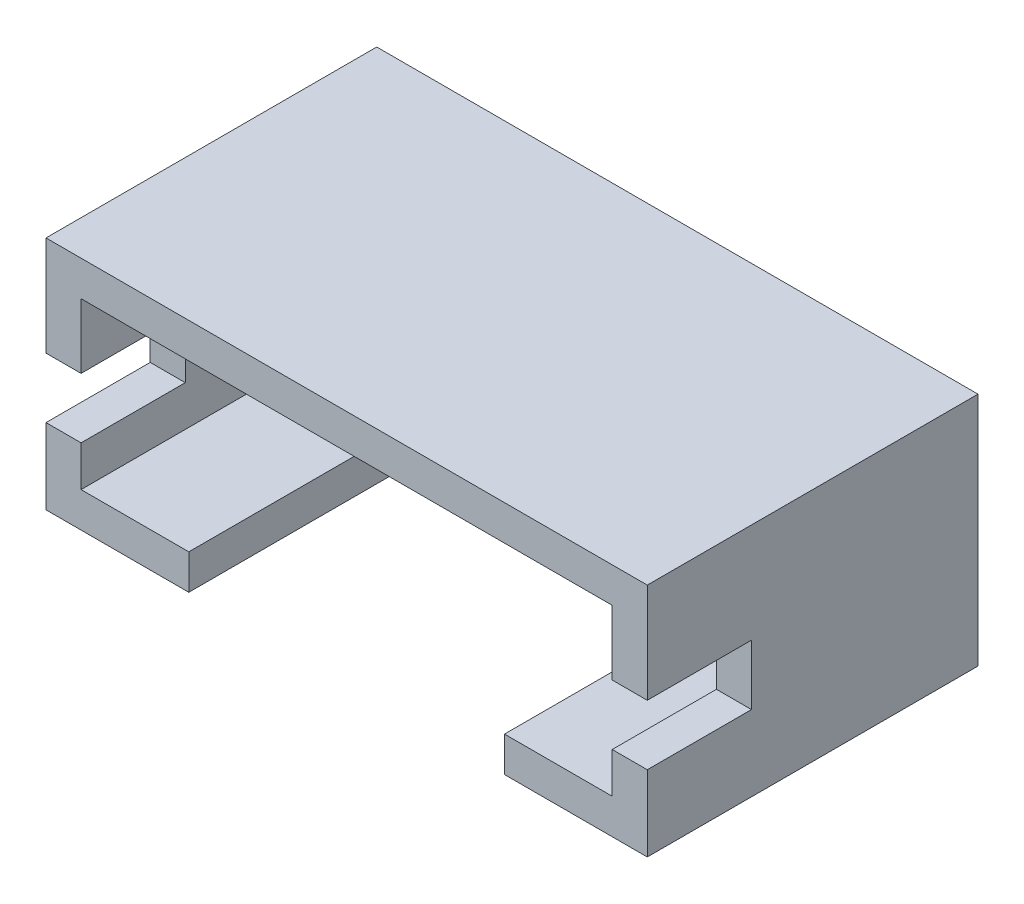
ISO-10303-21;
HEADER;
FILE_DESCRIPTION(('STEP AP214'),'2;1');
FILE_NAME('part.step','',(''),(''),'','','');
FILE_SCHEMA(('AUTOMOTIVE_DESIGN { 1 0 10303 214 1 1 1 1 }'));
ENDSEC;
DATA;
#1=APPLICATION_CONTEXT('core data for automotive mechanical design processes');
#2=APPLICATION_PROTOCOL_DEFINITION('international standard','automotive_design',2000,#1);
#3=PRODUCT_CONTEXT('',#1,'mechanical');
#4=PRODUCT('Part','Part','',(#3));
#5=PRODUCT_RELATED_PRODUCT_CATEGORY('part','',(#4));
#6=PRODUCT_DEFINITION_FORMATION('','',#4);
#7=PRODUCT_DEFINITION_CONTEXT('part definition',#1,'design');
#8=PRODUCT_DEFINITION('design','',#6,#7);
#9=PRODUCT_DEFINITION_SHAPE('','',#8);
#10=(LENGTH_UNIT() NAMED_UNIT(*) SI_UNIT(.MILLI.,.METRE.));
#11=(NAMED_UNIT(*) PLANE_ANGLE_UNIT() SI_UNIT($,.RADIAN.));
#12=(NAMED_UNIT(*) SI_UNIT($,.STERADIAN.) SOLID_ANGLE_UNIT());
#13=UNCERTAINTY_MEASURE_WITH_UNIT(LENGTH_MEASURE(1.E-05),#10,'distance_accuracy_value','');
#14=(GEOMETRIC_REPRESENTATION_CONTEXT(3) GLOBAL_UNCERTAINTY_ASSIGNED_CONTEXT((#13)) GLOBAL_UNIT_ASSIGNED_CONTEXT((#10,
#11,#12)) REPRESENTATION_CONTEXT('',''));
#15=CARTESIAN_POINT('',(0.,0.,0.));
#16=DIRECTION('',(0.,0.,1.));
#17=DIRECTION('',(1.,0.,0.));
#18=AXIS2_PLACEMENT_3D('',#15,#16,#17);
#19=CARTESIAN_POINT('',(22.2272344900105,4.7,0.));
#20=DIRECTION('',(0.,0.,-1.));
#21=DIRECTION('',(-1.,0.,0.));
#22=AXIS2_PLACEMENT_3D('',#19,#20,#21);
#23=PLANE('',#22);
#24=CARTESIAN_POINT('',(26.2426184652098,2.34999999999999,0.));
#25=DIRECTION('',(0.,0.,-1.));
#26=DIRECTION('',(-1.,0.,0.));
#27=AXIS2_PLACEMENT_3D('',#24,#25,#26);
#28=CIRCLE('',#27,0.302875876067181);
#29=CARTESIAN_POINT('',(25.9397425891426,2.34999999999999,0.));
#30=VERTEX_POINT('',#29);
#31=EDGE_CURVE('E691',#30,#30,#28,.F.);
#32=ORIENTED_EDGE('',*,*,#31,.T.);
#33=EDGE_LOOP('',(#32));
#34=FACE_BOUND('',#33,.T.);
#35=CARTESIAN_POINT('',(30.2426184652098,2.35,0.));
#36=DIRECTION('',(0.,0.,-1.));
#37=DIRECTION('',(-1.,0.,0.));
#38=AXIS2_PLACEMENT_3D('',#35,#36,#37);
#39=CIRCLE('',#38,0.302875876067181);
#40=CARTESIAN_POINT('',(29.9397425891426,2.35,0.));
#41=VERTEX_POINT('',#40);
#42=EDGE_CURVE('E708',#41,#41,#39,.F.);
#43=ORIENTED_EDGE('',*,*,#42,.T.);
#44=EDGE_LOOP('',(#43));
#45=FACE_BOUND('',#44,.T.);
#46=DIRECTION('',(0.,-1.,0.));
#47=VECTOR('',#46,1.);
#48=CARTESIAN_POINT('',(22.2272344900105,0.,0.));
#49=LINE('',#48,#47);
#50=CARTESIAN_POINT('',(22.2272344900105,4.7,0.));
#51=VERTEX_POINT('',#50);
#52=CARTESIAN_POINT('',(22.2272344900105,0.,0.));
#53=VERTEX_POINT('',#52);
#54=EDGE_CURVE('E345',#51,#53,#49,.T.);
#55=ORIENTED_EDGE('',*,*,#54,.F.);
#56=DIRECTION('',(-1.,0.,0.));
#57=VECTOR('',#56,1.);
#58=CARTESIAN_POINT('',(22.2272344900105,4.7,0.));
#59=LINE('',#58,#57);
#60=CARTESIAN_POINT('',(34.2272344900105,4.7,0.));
#61=VERTEX_POINT('',#60);
#62=EDGE_CURVE('E378',#61,#51,#59,.T.);
#63=ORIENTED_EDGE('',*,*,#62,.F.);
#64=DIRECTION('',(0.,1.,0.));
#65=VECTOR('',#64,1.);
#66=CARTESIAN_POINT('',(34.2272344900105,0.,0.));
#67=LINE('',#66,#65);
#68=CARTESIAN_POINT('',(34.2272344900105,0.,0.));
#69=VERTEX_POINT('',#68);
#70=EDGE_CURVE('E377',#69,#61,#67,.T.);
#71=ORIENTED_EDGE('',*,*,#70,.F.);
#72=DIRECTION('',(1.,0.,0.));
#73=VECTOR('',#72,1.);
#74=CARTESIAN_POINT('',(22.2272344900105,0.,0.));
#75=LINE('',#74,#73);
#76=EDGE_CURVE('E375',#53,#69,#75,.T.);
#77=ORIENTED_EDGE('',*,*,#76,.F.);
#78=EDGE_LOOP('',(#55,#63,#71,#77));
#79=FACE_BOUND('',#78,.T.);
#80=CARTESIAN_POINT('',(28.2272344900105,2.35,0.));
#81=DIRECTION('',(0.,0.,-1.));
#82=DIRECTION('',(-1.,0.,0.));
#83=AXIS2_PLACEMENT_3D('',#80,#81,#82);
#84=CIRCLE('',#83,0.302875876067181);
#85=CARTESIAN_POINT('',(27.9243586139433,2.35,0.));
#86=VERTEX_POINT('',#85);
#87=EDGE_CURVE('E413',#86,#86,#84,.F.);
#88=ORIENTED_EDGE('',*,*,#87,.T.);
#89=EDGE_LOOP('',(#88));
#90=FACE_BOUND('',#89,.T.);
#91=CARTESIAN_POINT('',(32.2580024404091,2.35,0.));
#92=DIRECTION('',(0.,0.,-1.));
#93=DIRECTION('',(-1.,0.,0.));
#94=AXIS2_PLACEMENT_3D('',#91,#92,#93);
#95=CIRCLE('',#94,0.302875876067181);
#96=CARTESIAN_POINT('',(31.9551265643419,2.35,0.));
#97=VERTEX_POINT('',#96);
#98=EDGE_CURVE('E699',#97,#97,#95,.F.);
#99=ORIENTED_EDGE('',*,*,#98,.T.);
#100=EDGE_LOOP('',(#99));
#101=FACE_BOUND('',#100,.T.);
#102=CARTESIAN_POINT('',(24.2580024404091,2.34999999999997,0.));
#103=DIRECTION('',(0.,0.,-1.));
#104=DIRECTION('',(-1.,0.,0.));
#105=AXIS2_PLACEMENT_3D('',#102,#103,#104);
#106=CIRCLE('',#105,0.302875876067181);
#107=CARTESIAN_POINT('',(23.9551265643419,2.34999999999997,0.));
#108=VERTEX_POINT('',#107);
#109=EDGE_CURVE('E680',#108,#108,#106,.F.);
#110=ORIENTED_EDGE('',*,*,#109,.T.);
#111=EDGE_LOOP('',(#110));
#112=FACE_BOUND('',#111,.T.);
#113=ADVANCED_FACE('F31',(#34,#45,#79,#90,#101,#112),#23,.T.);
#114=CARTESIAN_POINT('',(22.2272344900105,4.7,0.7));
#115=DIRECTION('',(0.,0.,-1.));
#116=DIRECTION('',(-1.,0.,0.));
#117=AXIS2_PLACEMENT_3D('',#114,#115,#116);
#118=PLANE('',#117);
#119=CARTESIAN_POINT('',(26.2426184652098,2.34999999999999,0.7));
#120=DIRECTION('',(0.,0.,-1.));
#121=DIRECTION('',(-1.,0.,0.));
#122=AXIS2_PLACEMENT_3D('',#119,#120,#121);
#123=CIRCLE('',#122,0.302875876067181);
#124=CARTESIAN_POINT('',(25.9397425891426,2.34999999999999,0.7));
#125=VERTEX_POINT('',#124);
#126=EDGE_CURVE('E39',#125,#125,#123,.F.);
#127=ORIENTED_EDGE('',*,*,#126,.F.);
#128=EDGE_LOOP('',(#127));
#129=FACE_BOUND('',#128,.T.);
#130=CARTESIAN_POINT('',(30.2426184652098,2.35,0.7));
#131=DIRECTION('',(0.,0.,-1.));
#132=DIRECTION('',(-1.,0.,0.));
#133=AXIS2_PLACEMENT_3D('',#130,#131,#132);
#134=CIRCLE('',#133,0.302875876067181);
#135=CARTESIAN_POINT('',(29.9397425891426,2.35,0.7));
#136=VERTEX_POINT('',#135);
#137=EDGE_CURVE('E228',#136,#136,#134,.F.);
#138=ORIENTED_EDGE('',*,*,#137,.F.);
#139=EDGE_LOOP('',(#138));
#140=FACE_BOUND('',#139,.T.);
#141=DIRECTION('',(0.,-1.,0.));
#142=VECTOR('',#141,1.);
#143=CARTESIAN_POINT('',(22.9272344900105,4.7,0.7));
#144=LINE('',#143,#142);
#145=CARTESIAN_POINT('',(22.9272344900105,4.,0.7));
#146=VERTEX_POINT('',#145);
#147=CARTESIAN_POINT('',(22.9272344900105,0.699999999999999,0.7));
#148=VERTEX_POINT('',#147);
#149=EDGE_CURVE('E247',#146,#148,#144,.T.);
#150=ORIENTED_EDGE('',*,*,#149,.T.);
#151=DIRECTION('',(1.,0.,0.));
#152=VECTOR('',#151,1.);
#153=CARTESIAN_POINT('',(22.2272344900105,0.699999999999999,0.7));
#154=LINE('',#153,#152);
#155=CARTESIAN_POINT('',(33.5272344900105,0.7,0.7));
#156=VERTEX_POINT('',#155);
#157=EDGE_CURVE('E341',#148,#156,#154,.T.);
#158=ORIENTED_EDGE('',*,*,#157,.T.);
#159=DIRECTION('',(0.,1.,0.));
#160=VECTOR('',#159,1.);
#161=CARTESIAN_POINT('',(33.5272344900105,4.7,0.7));
#162=LINE('',#161,#160);
#163=CARTESIAN_POINT('',(33.5272344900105,4.,0.7));
#164=VERTEX_POINT('',#163);
#165=EDGE_CURVE('E353',#156,#164,#162,.T.);
#166=ORIENTED_EDGE('',*,*,#165,.T.);
#167=DIRECTION('',(-1.,0.,0.));
#168=VECTOR('',#167,1.);
#169=CARTESIAN_POINT('',(22.2272344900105,4.,0.7));
#170=LINE('',#169,#168);
#171=EDGE_CURVE('E357',#164,#146,#170,.T.);
#172=ORIENTED_EDGE('',*,*,#171,.T.);
#173=EDGE_LOOP('',(#150,#158,#166,#172));
#174=FACE_BOUND('',#173,.T.);
#175=CARTESIAN_POINT('',(28.2272344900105,2.35,0.7));
#176=DIRECTION('',(0.,0.,-1.));
#177=DIRECTION('',(-1.,0.,0.));
#178=AXIS2_PLACEMENT_3D('',#175,#176,#177);
#179=CIRCLE('',#178,0.302875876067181);
#180=CARTESIAN_POINT('',(27.9243586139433,2.35,0.7));
#181=VERTEX_POINT('',#180);
#182=EDGE_CURVE('E225',#181,#181,#179,.F.);
#183=ORIENTED_EDGE('',*,*,#182,.F.);
#184=EDGE_LOOP('',(#183));
#185=FACE_BOUND('',#184,.T.);
#186=CARTESIAN_POINT('',(32.2580024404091,2.35,0.7));
#187=DIRECTION('',(0.,0.,-1.));
#188=DIRECTION('',(-1.,0.,0.));
#189=AXIS2_PLACEMENT_3D('',#186,#187,#188);
#190=CIRCLE('',#189,0.302875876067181);
#191=CARTESIAN_POINT('',(31.9551265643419,2.35,0.7));
#192=VERTEX_POINT('',#191);
#193=EDGE_CURVE('E231',#192,#192,#190,.F.);
#194=ORIENTED_EDGE('',*,*,#193,.F.);
#195=EDGE_LOOP('',(#194));
#196=FACE_BOUND('',#195,.T.);
#197=CARTESIAN_POINT('',(24.2580024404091,2.34999999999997,0.7));
#198=DIRECTION('',(0.,0.,-1.));
#199=DIRECTION('',(-1.,0.,0.));
#200=AXIS2_PLACEMENT_3D('',#197,#198,#199);
#201=CIRCLE('',#200,0.302875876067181);
#202=CARTESIAN_POINT('',(23.9551265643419,2.34999999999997,0.7));
#203=VERTEX_POINT('',#202);
#204=EDGE_CURVE('E11',#203,#203,#201,.F.);
#205=ORIENTED_EDGE('',*,*,#204,.F.);
#206=EDGE_LOOP('',(#205));
#207=FACE_BOUND('',#206,.T.);
#208=ADVANCED_FACE('F238',(#129,#140,#174,#185,#196,#207),#118,.F.);
#209=CARTESIAN_POINT('',(22.2272344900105,4.7,6.6));
#210=DIRECTION('',(0.,0.,-1.));
#211=DIRECTION('',(-1.,0.,0.));
#212=AXIS2_PLACEMENT_3D('',#209,#210,#211);
#213=PLANE('',#212);
#214=DIRECTION('',(1.,0.,0.));
#215=VECTOR('',#214,1.);
#216=CARTESIAN_POINT('',(22.2272344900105,0.,6.6));
#217=LINE('',#216,#215);
#218=CARTESIAN_POINT('',(22.2272344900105,0.,6.6));
#219=VERTEX_POINT('',#218);
#220=CARTESIAN_POINT('',(25.0772344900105,0.,6.6));
#221=VERTEX_POINT('',#220);
#222=EDGE_CURVE('E187',#219,#221,#217,.T.);
#223=ORIENTED_EDGE('',*,*,#222,.T.);
#224=DIRECTION('',(0.,-1.,0.));
#225=VECTOR('',#224,1.);
#226=CARTESIAN_POINT('',(25.0772344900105,4.701,6.6));
#227=LINE('',#226,#225);
#228=CARTESIAN_POINT('',(25.0772344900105,0.699999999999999,6.6));
#229=VERTEX_POINT('',#228);
#230=EDGE_CURVE('E168',#229,#221,#227,.T.);
#231=ORIENTED_EDGE('',*,*,#230,.F.);
#232=DIRECTION('',(1.,0.,0.));
#233=VECTOR('',#232,1.);
#234=CARTESIAN_POINT('',(22.2272344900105,0.699999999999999,6.6));
#235=LINE('',#234,#233);
#236=CARTESIAN_POINT('',(22.9272344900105,0.699999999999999,6.6));
#237=VERTEX_POINT('',#236);
#238=EDGE_CURVE('E366',#237,#229,#235,.T.);
#239=ORIENTED_EDGE('',*,*,#238,.F.);
#240=DIRECTION('',(0.,-1.,0.));
#241=VECTOR('',#240,1.);
#242=CARTESIAN_POINT('',(22.9272344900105,4.7,6.6));
#243=LINE('',#242,#241);
#244=CARTESIAN_POINT('',(22.9272344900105,1.50856992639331,6.6));
#245=VERTEX_POINT('',#244);
#246=EDGE_CURVE('E361',#245,#237,#243,.T.);
#247=ORIENTED_EDGE('',*,*,#246,.F.);
#248=DIRECTION('',(1.,0.,0.));
#249=VECTOR('',#248,1.);
#250=CARTESIAN_POINT('',(22.2272344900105,1.50856992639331,6.6));
#251=LINE('',#250,#249);
#252=CARTESIAN_POINT('',(22.2272344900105,1.50856992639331,6.6));
#253=VERTEX_POINT('',#252);
#254=EDGE_CURVE('E54',#253,#245,#251,.T.);
#255=ORIENTED_EDGE('',*,*,#254,.F.);
#256=DIRECTION('',(0.,-1.,0.));
#257=VECTOR('',#256,1.);
#258=CARTESIAN_POINT('',(22.2272344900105,0.,6.6));
#259=LINE('',#258,#257);
#260=EDGE_CURVE('E194',#253,#219,#259,.T.);
#261=ORIENTED_EDGE('',*,*,#260,.T.);
#262=EDGE_LOOP('',(#223,#231,#239,#247,#255,#261));
#263=FACE_BOUND('',#262,.T.);
#264=ADVANCED_FACE('F192',(#263),#213,.F.);
#265=CARTESIAN_POINT('',(22.2272344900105,4.7,6.6));
#266=VERTEX_POINT('',#265);
#267=CARTESIAN_POINT('',(22.2272344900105,2.70856992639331,6.6));
#268=VERTEX_POINT('',#267);
#269=EDGE_CURVE('E200',#266,#268,#259,.T.);
#270=ORIENTED_EDGE('',*,*,#269,.T.);
#271=DIRECTION('',(1.,0.,0.));
#272=VECTOR('',#271,1.);
#273=CARTESIAN_POINT('',(22.2272344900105,2.70856992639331,6.6));
#274=LINE('',#273,#272);
#275=CARTESIAN_POINT('',(22.9272344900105,2.70856992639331,6.6));
#276=VERTEX_POINT('',#275);
#277=EDGE_CURVE('E322',#268,#276,#274,.T.);
#278=ORIENTED_EDGE('',*,*,#277,.T.);
#279=CARTESIAN_POINT('',(22.9272344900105,4.,6.6));
#280=VERTEX_POINT('',#279);
#281=EDGE_CURVE('E362',#280,#276,#243,.T.);
#282=ORIENTED_EDGE('',*,*,#281,.F.);
#283=DIRECTION('',(-1.,0.,0.));
#284=VECTOR('',#283,1.);
#285=CARTESIAN_POINT('',(22.2272344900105,4.,6.6));
#286=LINE('',#285,#284);
#287=CARTESIAN_POINT('',(33.5272344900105,4.,6.6));
#288=VERTEX_POINT('',#287);
#289=EDGE_CURVE('E351',#288,#280,#286,.T.);
#290=ORIENTED_EDGE('',*,*,#289,.F.);
#291=DIRECTION('',(0.,1.,0.));
#292=VECTOR('',#291,1.);
#293=CARTESIAN_POINT('',(33.5272344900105,4.7,6.6));
#294=LINE('',#293,#292);
#295=CARTESIAN_POINT('',(33.5272344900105,2.70856992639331,6.6));
#296=VERTEX_POINT('',#295);
#297=EDGE_CURVE('E368',#296,#288,#294,.T.);
#298=ORIENTED_EDGE('',*,*,#297,.F.);
#299=CARTESIAN_POINT('',(34.2272344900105,2.70856992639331,6.6));
#300=VERTEX_POINT('',#299);
#301=EDGE_CURVE('E326',#296,#300,#274,.T.);
#302=ORIENTED_EDGE('',*,*,#301,.T.);
#303=DIRECTION('',(0.,1.,0.));
#304=VECTOR('',#303,1.);
#305=CARTESIAN_POINT('',(34.2272344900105,0.,6.6));
#306=LINE('',#305,#304);
#307=CARTESIAN_POINT('',(34.2272344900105,4.7,6.6));
#308=VERTEX_POINT('',#307);
#309=EDGE_CURVE('E195',#300,#308,#306,.T.);
#310=ORIENTED_EDGE('',*,*,#309,.T.);
#311=DIRECTION('',(-1.,0.,0.));
#312=VECTOR('',#311,1.);
#313=CARTESIAN_POINT('',(22.2272344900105,4.7,6.6));
#314=LINE('',#313,#312);
#315=EDGE_CURVE('E205',#308,#266,#314,.T.);
#316=ORIENTED_EDGE('',*,*,#315,.T.);
#317=EDGE_LOOP('',(#270,#278,#282,#290,#298,#302,#310,#316));
#318=FACE_BOUND('',#317,.T.);
#319=ADVANCED_FACE('F284',(#318),#213,.F.);
#320=CARTESIAN_POINT('',(31.3772344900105,0.7,6.6));
#321=VERTEX_POINT('',#320);
#322=CARTESIAN_POINT('',(33.5272344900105,0.7,6.6));
#323=VERTEX_POINT('',#322);
#324=EDGE_CURVE('E365',#321,#323,#235,.T.);
#325=ORIENTED_EDGE('',*,*,#324,.F.);
#326=DIRECTION('',(0.,-1.,0.));
#327=VECTOR('',#326,1.);
#328=CARTESIAN_POINT('',(31.3772344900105,4.701,6.6));
#329=LINE('',#328,#327);
#330=CARTESIAN_POINT('',(31.3772344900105,0.,6.6));
#331=VERTEX_POINT('',#330);
#332=EDGE_CURVE('E401',#321,#331,#329,.T.);
#333=ORIENTED_EDGE('',*,*,#332,.T.);
#334=CARTESIAN_POINT('',(34.2272344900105,0.,6.6));
#335=VERTEX_POINT('',#334);
#336=EDGE_CURVE('E196',#331,#335,#217,.T.);
#337=ORIENTED_EDGE('',*,*,#336,.T.);
#338=CARTESIAN_POINT('',(34.2272344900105,1.50856992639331,6.6));
#339=VERTEX_POINT('',#338);
#340=EDGE_CURVE('E198',#335,#339,#306,.T.);
#341=ORIENTED_EDGE('',*,*,#340,.T.);
#342=CARTESIAN_POINT('',(33.5272344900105,1.50856992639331,6.6));
#343=VERTEX_POINT('',#342);
#344=EDGE_CURVE('E316',#343,#339,#251,.T.);
#345=ORIENTED_EDGE('',*,*,#344,.F.);
#346=EDGE_CURVE('E369',#323,#343,#294,.T.);
#347=ORIENTED_EDGE('',*,*,#346,.F.);
#348=EDGE_LOOP('',(#325,#333,#337,#341,#345,#347));
#349=FACE_BOUND('',#348,.T.);
#350=ADVANCED_FACE('F281',(#349),#213,.F.);
#351=CARTESIAN_POINT('',(22.2272344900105,0.,6.6));
#352=DIRECTION('',(1.,0.,0.));
#353=DIRECTION('',(0.,0.,-1.));
#354=AXIS2_PLACEMENT_3D('',#351,#352,#353);
#355=PLANE('',#354);
#356=DIRECTION('',(0.,1.,0.));
#357=VECTOR('',#356,1.);
#358=CARTESIAN_POINT('',(22.2272344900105,1.50856992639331,4.52038481));
#359=LINE('',#358,#357);
#360=CARTESIAN_POINT('',(22.2272344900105,1.50856992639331,4.52038481));
#361=VERTEX_POINT('',#360);
#362=CARTESIAN_POINT('',(22.2272344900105,2.70856992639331,4.52038481));
#363=VERTEX_POINT('',#362);
#364=EDGE_CURVE('E307',#361,#363,#359,.T.);
#365=ORIENTED_EDGE('',*,*,#364,.T.);
#366=DIRECTION('',(0.,0.,1.));
#367=VECTOR('',#366,1.);
#368=CARTESIAN_POINT('',(22.2272344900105,2.70856992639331,6.6));
#369=LINE('',#368,#367);
#370=EDGE_CURVE('E310',#363,#268,#369,.T.);
#371=ORIENTED_EDGE('',*,*,#370,.T.);
#372=ORIENTED_EDGE('',*,*,#269,.F.);
#373=DIRECTION('',(0.,0.,-1.));
#374=VECTOR('',#373,1.);
#375=CARTESIAN_POINT('',(22.2272344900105,4.7,6.6));
#376=LINE('',#375,#374);
#377=EDGE_CURVE('E207',#266,#51,#376,.T.);
#378=ORIENTED_EDGE('',*,*,#377,.T.);
#379=ORIENTED_EDGE('',*,*,#54,.T.);
#380=DIRECTION('',(0.,0.,-1.));
#381=VECTOR('',#380,1.);
#382=CARTESIAN_POINT('',(22.2272344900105,0.,6.6));
#383=LINE('',#382,#381);
#384=EDGE_CURVE('E216',#219,#53,#383,.T.);
#385=ORIENTED_EDGE('',*,*,#384,.F.);
#386=ORIENTED_EDGE('',*,*,#260,.F.);
#387=DIRECTION('',(0.,0.,-1.));
#388=VECTOR('',#387,1.);
#389=CARTESIAN_POINT('',(22.2272344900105,1.50856992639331,6.6));
#390=LINE('',#389,#388);
#391=EDGE_CURVE('E312',#253,#361,#390,.T.);
#392=ORIENTED_EDGE('',*,*,#391,.T.);
#393=EDGE_LOOP('',(#365,#371,#372,#378,#379,#385,#386,#392));
#394=FACE_BOUND('',#393,.T.);
#395=ADVANCED_FACE('F33',(#394),#355,.F.);
#396=CARTESIAN_POINT('',(22.2272344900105,0.,6.6));
#397=DIRECTION('',(0.,1.,0.));
#398=DIRECTION('',(-1.,0.,0.));
#399=AXIS2_PLACEMENT_3D('',#396,#397,#398);
#400=PLANE('',#399);
#401=DIRECTION('',(1.,0.,0.));
#402=VECTOR('',#401,1.);
#403=CARTESIAN_POINT('',(25.0772344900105,0.,1.16189975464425));
#404=LINE('',#403,#402);
#405=CARTESIAN_POINT('',(25.0772344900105,0.,1.16189975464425));
#406=VERTEX_POINT('',#405);
#407=CARTESIAN_POINT('',(31.3772344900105,0.,1.16189975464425));
#408=VERTEX_POINT('',#407);
#409=EDGE_CURVE('E190',#406,#408,#404,.T.);
#410=ORIENTED_EDGE('',*,*,#409,.F.);
#411=DIRECTION('',(0.,0.,-1.));
#412=VECTOR('',#411,1.);
#413=CARTESIAN_POINT('',(25.0772344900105,0.,6.6));
#414=LINE('',#413,#412);
#415=EDGE_CURVE('E172',#221,#406,#414,.T.);
#416=ORIENTED_EDGE('',*,*,#415,.F.);
#417=ORIENTED_EDGE('',*,*,#222,.F.);
#418=ORIENTED_EDGE('',*,*,#384,.T.);
#419=ORIENTED_EDGE('',*,*,#76,.T.);
#420=DIRECTION('',(0.,0.,-1.));
#421=VECTOR('',#420,1.);
#422=CARTESIAN_POINT('',(34.2272344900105,0.,6.6));
#423=LINE('',#422,#421);
#424=EDGE_CURVE('E213',#335,#69,#423,.T.);
#425=ORIENTED_EDGE('',*,*,#424,.F.);
#426=ORIENTED_EDGE('',*,*,#336,.F.);
#427=DIRECTION('',(0.,0.,1.));
#428=VECTOR('',#427,1.);
#429=CARTESIAN_POINT('',(31.3772344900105,0.,6.6));
#430=LINE('',#429,#428);
#431=EDGE_CURVE('E402',#408,#331,#430,.T.);
#432=ORIENTED_EDGE('',*,*,#431,.F.);
#433=EDGE_LOOP('',(#410,#416,#417,#418,#419,#425,#426,#432));
#434=FACE_BOUND('',#433,.T.);
#435=ADVANCED_FACE('F185',(#434),#400,.F.);
#436=CARTESIAN_POINT('',(34.2272344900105,0.,6.6));
#437=DIRECTION('',(-1.,0.,0.));
#438=DIRECTION('',(0.,0.,1.));
#439=AXIS2_PLACEMENT_3D('',#436,#437,#438);
#440=PLANE('',#439);
#441=ORIENTED_EDGE('',*,*,#309,.F.);
#442=DIRECTION('',(0.,0.,1.));
#443=VECTOR('',#442,1.);
#444=CARTESIAN_POINT('',(34.2272344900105,2.70856992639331,6.6));
#445=LINE('',#444,#443);
#446=CARTESIAN_POINT('',(34.2272344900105,2.70856992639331,4.52038481));
#447=VERTEX_POINT('',#446);
#448=EDGE_CURVE('E318',#447,#300,#445,.T.);
#449=ORIENTED_EDGE('',*,*,#448,.F.);
#450=DIRECTION('',(0.,1.,0.));
#451=VECTOR('',#450,1.);
#452=CARTESIAN_POINT('',(34.2272344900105,1.50856992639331,4.52038481));
#453=LINE('',#452,#451);
#454=CARTESIAN_POINT('',(34.2272344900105,1.50856992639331,4.52038481));
#455=VERTEX_POINT('',#454);
#456=EDGE_CURVE('E405',#455,#447,#453,.T.);
#457=ORIENTED_EDGE('',*,*,#456,.F.);
#458=DIRECTION('',(0.,0.,-1.));
#459=VECTOR('',#458,1.);
#460=CARTESIAN_POINT('',(34.2272344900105,1.50856992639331,6.6));
#461=LINE('',#460,#459);
#462=EDGE_CURVE('E396',#339,#455,#461,.T.);
#463=ORIENTED_EDGE('',*,*,#462,.F.);
#464=ORIENTED_EDGE('',*,*,#340,.F.);
#465=ORIENTED_EDGE('',*,*,#424,.T.);
#466=ORIENTED_EDGE('',*,*,#70,.T.);
#467=DIRECTION('',(0.,0.,-1.));
#468=VECTOR('',#467,1.);
#469=CARTESIAN_POINT('',(34.2272344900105,4.7,6.6));
#470=LINE('',#469,#468);
#471=EDGE_CURVE('E210',#308,#61,#470,.T.);
#472=ORIENTED_EDGE('',*,*,#471,.F.);
#473=EDGE_LOOP('',(#441,#449,#457,#463,#464,#465,#466,#472));
#474=FACE_BOUND('',#473,.T.);
#475=ADVANCED_FACE('F290',(#474),#440,.F.);
#476=CARTESIAN_POINT('',(22.2272344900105,4.7,6.6));
#477=DIRECTION('',(0.,-1.,0.));
#478=DIRECTION('',(0.,0.,-1.));
#479=AXIS2_PLACEMENT_3D('',#476,#477,#478);
#480=PLANE('',#479);
#481=ORIENTED_EDGE('',*,*,#62,.T.);
#482=ORIENTED_EDGE('',*,*,#377,.F.);
#483=ORIENTED_EDGE('',*,*,#315,.F.);
#484=ORIENTED_EDGE('',*,*,#471,.T.);
#485=EDGE_LOOP('',(#481,#482,#483,#484));
#486=FACE_BOUND('',#485,.T.);
#487=ADVANCED_FACE('F286',(#486),#480,.F.);
#488=CARTESIAN_POINT('',(22.9272344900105,0.,6.6));
#489=DIRECTION('',(1.,0.,0.));
#490=DIRECTION('',(0.,0.,-1.));
#491=AXIS2_PLACEMENT_3D('',#488,#489,#490);
#492=PLANE('',#491);
#493=DIRECTION('',(0.,0.,1.));
#494=VECTOR('',#493,1.);
#495=CARTESIAN_POINT('',(22.9272344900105,2.70856992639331,6.6));
#496=LINE('',#495,#494);
#497=CARTESIAN_POINT('',(22.9272344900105,2.70856992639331,4.52038481));
#498=VERTEX_POINT('',#497);
#499=EDGE_CURVE('E338',#498,#276,#496,.T.);
#500=ORIENTED_EDGE('',*,*,#499,.F.);
#501=DIRECTION('',(0.,1.,0.));
#502=VECTOR('',#501,1.);
#503=CARTESIAN_POINT('',(22.9272344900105,0.,4.52038481));
#504=LINE('',#503,#502);
#505=CARTESIAN_POINT('',(22.9272344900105,1.50856992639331,4.52038481));
#506=VERTEX_POINT('',#505);
#507=EDGE_CURVE('E336',#506,#498,#504,.T.);
#508=ORIENTED_EDGE('',*,*,#507,.F.);
#509=DIRECTION('',(0.,0.,-1.));
#510=VECTOR('',#509,1.);
#511=CARTESIAN_POINT('',(22.9272344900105,1.50856992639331,6.6));
#512=LINE('',#511,#510);
#513=EDGE_CURVE('E325',#245,#506,#512,.T.);
#514=ORIENTED_EDGE('',*,*,#513,.F.);
#515=ORIENTED_EDGE('',*,*,#246,.T.);
#516=DIRECTION('',(0.,0.,-1.));
#517=VECTOR('',#516,1.);
#518=CARTESIAN_POINT('',(22.9272344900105,0.699999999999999,6.6));
#519=LINE('',#518,#517);
#520=EDGE_CURVE('E342',#237,#148,#519,.T.);
#521=ORIENTED_EDGE('',*,*,#520,.T.);
#522=ORIENTED_EDGE('',*,*,#149,.F.);
#523=DIRECTION('',(0.,0.,-1.));
#524=VECTOR('',#523,1.);
#525=CARTESIAN_POINT('',(22.9272344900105,4.,6.6));
#526=LINE('',#525,#524);
#527=EDGE_CURVE('E347',#280,#146,#526,.T.);
#528=ORIENTED_EDGE('',*,*,#527,.F.);
#529=ORIENTED_EDGE('',*,*,#281,.T.);
#530=EDGE_LOOP('',(#500,#508,#514,#515,#521,#522,#528,#529));
#531=FACE_BOUND('',#530,.T.);
#532=ADVANCED_FACE('F289',(#531),#492,.T.);
#533=CARTESIAN_POINT('',(22.2272344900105,0.699999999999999,6.6));
#534=DIRECTION('',(0.,1.,0.));
#535=DIRECTION('',(-1.,0.,0.));
#536=AXIS2_PLACEMENT_3D('',#533,#534,#535);
#537=PLANE('',#536);
#538=DIRECTION('',(0.,0.,-1.));
#539=VECTOR('',#538,1.);
#540=CARTESIAN_POINT('',(25.0772344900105,0.699999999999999,6.6));
#541=LINE('',#540,#539);
#542=CARTESIAN_POINT('',(25.0772344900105,0.699999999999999,1.16189975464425));
#543=VERTEX_POINT('',#542);
#544=EDGE_CURVE('E175',#229,#543,#541,.T.);
#545=ORIENTED_EDGE('',*,*,#544,.T.);
#546=DIRECTION('',(1.,0.,0.));
#547=VECTOR('',#546,1.);
#548=CARTESIAN_POINT('',(25.0772344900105,0.699999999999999,1.16189975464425));
#549=LINE('',#548,#547);
#550=CARTESIAN_POINT('',(31.3772344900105,0.7,1.16189975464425));
#551=VERTEX_POINT('',#550);
#552=EDGE_CURVE('E409',#543,#551,#549,.T.);
#553=ORIENTED_EDGE('',*,*,#552,.T.);
#554=DIRECTION('',(0.,0.,1.));
#555=VECTOR('',#554,1.);
#556=CARTESIAN_POINT('',(31.3772344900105,0.7,6.6));
#557=LINE('',#556,#555);
#558=EDGE_CURVE('E180',#551,#321,#557,.T.);
#559=ORIENTED_EDGE('',*,*,#558,.T.);
#560=ORIENTED_EDGE('',*,*,#324,.T.);
#561=DIRECTION('',(0.,0.,-1.));
#562=VECTOR('',#561,1.);
#563=CARTESIAN_POINT('',(33.5272344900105,0.7,6.6));
#564=LINE('',#563,#562);
#565=EDGE_CURVE('E346',#323,#156,#564,.T.);
#566=ORIENTED_EDGE('',*,*,#565,.T.);
#567=ORIENTED_EDGE('',*,*,#157,.F.);
#568=ORIENTED_EDGE('',*,*,#520,.F.);
#569=ORIENTED_EDGE('',*,*,#238,.T.);
#570=EDGE_LOOP('',(#545,#553,#559,#560,#566,#567,#568,#569));
#571=FACE_BOUND('',#570,.T.);
#572=ADVANCED_FACE('F440',(#571),#537,.T.);
#573=CARTESIAN_POINT('',(33.5272344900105,0.,6.6));
#574=DIRECTION('',(-1.,0.,0.));
#575=DIRECTION('',(0.,0.,1.));
#576=AXIS2_PLACEMENT_3D('',#573,#574,#575);
#577=PLANE('',#576);
#578=DIRECTION('',(0.,0.,-1.));
#579=VECTOR('',#578,1.);
#580=CARTESIAN_POINT('',(33.5272344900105,2.70856992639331,6.6));
#581=LINE('',#580,#579);
#582=CARTESIAN_POINT('',(33.5272344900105,2.70856992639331,4.52038481));
#583=VERTEX_POINT('',#582);
#584=EDGE_CURVE('E223',#296,#583,#581,.T.);
#585=ORIENTED_EDGE('',*,*,#584,.F.);
#586=ORIENTED_EDGE('',*,*,#297,.T.);
#587=DIRECTION('',(0.,0.,-1.));
#588=VECTOR('',#587,1.);
#589=CARTESIAN_POINT('',(33.5272344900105,4.,6.6));
#590=LINE('',#589,#588);
#591=EDGE_CURVE('E350',#288,#164,#590,.T.);
#592=ORIENTED_EDGE('',*,*,#591,.T.);
#593=ORIENTED_EDGE('',*,*,#165,.F.);
#594=ORIENTED_EDGE('',*,*,#565,.F.);
#595=ORIENTED_EDGE('',*,*,#346,.T.);
#596=DIRECTION('',(0.,0.,1.));
#597=VECTOR('',#596,1.);
#598=CARTESIAN_POINT('',(33.5272344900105,1.50856992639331,6.6));
#599=LINE('',#598,#597);
#600=CARTESIAN_POINT('',(33.5272344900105,1.50856992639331,4.52038481));
#601=VERTEX_POINT('',#600);
#602=EDGE_CURVE('E218',#601,#343,#599,.T.);
#603=ORIENTED_EDGE('',*,*,#602,.F.);
#604=DIRECTION('',(0.,-1.,0.));
#605=VECTOR('',#604,1.);
#606=CARTESIAN_POINT('',(33.5272344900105,0.,4.52038481));
#607=LINE('',#606,#605);
#608=EDGE_CURVE('E220',#583,#601,#607,.T.);
#609=ORIENTED_EDGE('',*,*,#608,.F.);
#610=EDGE_LOOP('',(#585,#586,#592,#593,#594,#595,#603,#609));
#611=FACE_BOUND('',#610,.T.);
#612=ADVANCED_FACE('F430',(#611),#577,.T.);
#613=CARTESIAN_POINT('',(22.2272344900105,4.,6.6));
#614=DIRECTION('',(0.,-1.,0.));
#615=DIRECTION('',(0.,0.,-1.));
#616=AXIS2_PLACEMENT_3D('',#613,#614,#615);
#617=PLANE('',#616);
#618=ORIENTED_EDGE('',*,*,#171,.F.);
#619=ORIENTED_EDGE('',*,*,#591,.F.);
#620=ORIENTED_EDGE('',*,*,#289,.T.);
#621=ORIENTED_EDGE('',*,*,#527,.T.);
#622=EDGE_LOOP('',(#618,#619,#620,#621));
#623=FACE_BOUND('',#622,.T.);
#624=ADVANCED_FACE('F435',(#623),#617,.T.);
#625=CARTESIAN_POINT('',(22.2272344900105,1.50856992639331,6.6));
#626=DIRECTION('',(0.,-1.,0.));
#627=DIRECTION('',(0.,0.,-1.));
#628=AXIS2_PLACEMENT_3D('',#625,#626,#627);
#629=PLANE('',#628);
#630=ORIENTED_EDGE('',*,*,#602,.T.);
#631=ORIENTED_EDGE('',*,*,#344,.T.);
#632=ORIENTED_EDGE('',*,*,#462,.T.);
#633=DIRECTION('',(1.,0.,0.));
#634=VECTOR('',#633,1.);
#635=CARTESIAN_POINT('',(22.2272344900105,1.50856992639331,4.52038481));
#636=LINE('',#635,#634);
#637=EDGE_CURVE('E333',#601,#455,#636,.T.);
#638=ORIENTED_EDGE('',*,*,#637,.F.);
#639=EDGE_LOOP('',(#630,#631,#632,#638));
#640=FACE_BOUND('',#639,.T.);
#641=ADVANCED_FACE('F465',(#640),#629,.F.);
#642=CARTESIAN_POINT('',(22.2272344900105,1.50856992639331,4.52038481));
#643=DIRECTION('',(0.,0.,-1.));
#644=DIRECTION('',(-1.,0.,0.));
#645=AXIS2_PLACEMENT_3D('',#642,#643,#644);
#646=PLANE('',#645);
#647=ORIENTED_EDGE('',*,*,#608,.T.);
#648=ORIENTED_EDGE('',*,*,#637,.T.);
#649=ORIENTED_EDGE('',*,*,#456,.T.);
#650=DIRECTION('',(1.,0.,0.));
#651=VECTOR('',#650,1.);
#652=CARTESIAN_POINT('',(22.2272344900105,2.70856992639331,4.52038481));
#653=LINE('',#652,#651);
#654=EDGE_CURVE('E330',#583,#447,#653,.T.);
#655=ORIENTED_EDGE('',*,*,#654,.F.);
#656=EDGE_LOOP('',(#647,#648,#649,#655));
#657=FACE_BOUND('',#656,.T.);
#658=ADVANCED_FACE('F460',(#657),#646,.F.);
#659=CARTESIAN_POINT('',(22.2272344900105,2.70856992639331,6.6));
#660=DIRECTION('',(0.,1.,0.));
#661=DIRECTION('',(0.,0.,1.));
#662=AXIS2_PLACEMENT_3D('',#659,#660,#661);
#663=PLANE('',#662);
#664=ORIENTED_EDGE('',*,*,#584,.T.);
#665=ORIENTED_EDGE('',*,*,#654,.T.);
#666=ORIENTED_EDGE('',*,*,#448,.T.);
#667=ORIENTED_EDGE('',*,*,#301,.F.);
#668=EDGE_LOOP('',(#664,#665,#666,#667));
#669=FACE_BOUND('',#668,.T.);
#670=ADVANCED_FACE('F423',(#669),#663,.F.);
#671=ORIENTED_EDGE('',*,*,#499,.T.);
#672=ORIENTED_EDGE('',*,*,#277,.F.);
#673=ORIENTED_EDGE('',*,*,#370,.F.);
#674=EDGE_CURVE('E327',#363,#498,#653,.T.);
#675=ORIENTED_EDGE('',*,*,#674,.T.);
#676=EDGE_LOOP('',(#671,#672,#673,#675));
#677=FACE_BOUND('',#676,.T.);
#678=ADVANCED_FACE('F452',(#677),#663,.F.);
#679=ORIENTED_EDGE('',*,*,#507,.T.);
#680=ORIENTED_EDGE('',*,*,#674,.F.);
#681=ORIENTED_EDGE('',*,*,#364,.F.);
#682=EDGE_CURVE('E331',#361,#506,#636,.T.);
#683=ORIENTED_EDGE('',*,*,#682,.T.);
#684=EDGE_LOOP('',(#679,#680,#681,#683));
#685=FACE_BOUND('',#684,.T.);
#686=ADVANCED_FACE('F450',(#685),#646,.F.);
#687=ORIENTED_EDGE('',*,*,#513,.T.);
#688=ORIENTED_EDGE('',*,*,#682,.F.);
#689=ORIENTED_EDGE('',*,*,#391,.F.);
#690=ORIENTED_EDGE('',*,*,#254,.T.);
#691=EDGE_LOOP('',(#687,#688,#689,#690));
#692=FACE_BOUND('',#691,.T.);
#693=ADVANCED_FACE('F449',(#692),#629,.F.);
#694=CARTESIAN_POINT('',(25.0772344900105,4.701,6.6));
#695=DIRECTION('',(-1.,0.,0.));
#696=DIRECTION('',(0.,-1.,0.));
#697=AXIS2_PLACEMENT_3D('',#694,#695,#696);
#698=PLANE('',#697);
#699=ORIENTED_EDGE('',*,*,#230,.T.);
#700=ORIENTED_EDGE('',*,*,#415,.T.);
#701=DIRECTION('',(0.,-1.,0.));
#702=VECTOR('',#701,1.);
#703=CARTESIAN_POINT('',(25.0772344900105,4.701,1.16189975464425));
#704=LINE('',#703,#702);
#705=EDGE_CURVE('E181',#543,#406,#704,.T.);
#706=ORIENTED_EDGE('',*,*,#705,.F.);
#707=ORIENTED_EDGE('',*,*,#544,.F.);
#708=EDGE_LOOP('',(#699,#700,#706,#707));
#709=FACE_BOUND('',#708,.T.);
#710=ADVANCED_FACE('F170',(#709),#698,.F.);
#711=CARTESIAN_POINT('',(31.3772344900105,4.701,6.6));
#712=DIRECTION('',(1.,0.,0.));
#713=DIRECTION('',(0.,1.,0.));
#714=AXIS2_PLACEMENT_3D('',#711,#712,#713);
#715=PLANE('',#714);
#716=DIRECTION('',(0.,-1.,0.));
#717=VECTOR('',#716,1.);
#718=CARTESIAN_POINT('',(31.3772344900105,4.701,1.16189975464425));
#719=LINE('',#718,#717);
#720=EDGE_CURVE('E46',#551,#408,#719,.T.);
#721=ORIENTED_EDGE('',*,*,#720,.T.);
#722=ORIENTED_EDGE('',*,*,#431,.T.);
#723=ORIENTED_EDGE('',*,*,#332,.F.);
#724=ORIENTED_EDGE('',*,*,#558,.F.);
#725=EDGE_LOOP('',(#721,#722,#723,#724));
#726=FACE_BOUND('',#725,.T.);
#727=ADVANCED_FACE('F442',(#726),#715,.F.);
#728=CARTESIAN_POINT('',(25.0772344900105,4.701,1.16189975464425));
#729=DIRECTION('',(0.,0.,-1.));
#730=DIRECTION('',(-1.,0.,0.));
#731=AXIS2_PLACEMENT_3D('',#728,#729,#730);
#732=PLANE('',#731);
#733=ORIENTED_EDGE('',*,*,#705,.T.);
#734=ORIENTED_EDGE('',*,*,#409,.T.);
#735=ORIENTED_EDGE('',*,*,#720,.F.);
#736=ORIENTED_EDGE('',*,*,#552,.F.);
#737=EDGE_LOOP('',(#733,#734,#735,#736));
#738=FACE_BOUND('',#737,.T.);
#739=ADVANCED_FACE('F443',(#738),#732,.F.);
#740=CARTESIAN_POINT('',(28.2272344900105,2.35,3.7));
#741=DIRECTION('',(0.,0.,1.));
#742=DIRECTION('',(1.,0.,0.));
#743=AXIS2_PLACEMENT_3D('',#740,#741,#742);
#744=PLANE('',#743);
#745=CARTESIAN_POINT('',(28.2272344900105,2.35,3.7));
#746=DIRECTION('',(0.,0.,1.));
#747=DIRECTION('',(1.,0.,0.));
#748=AXIS2_PLACEMENT_3D('',#745,#746,#747);
#749=CIRCLE('',#748,0.302875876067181);
#750=CARTESIAN_POINT('',(28.5301103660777,2.35,3.7));
#751=VERTEX_POINT('',#750);
#752=EDGE_CURVE('E714',#751,#751,#749,.T.);
#753=ORIENTED_EDGE('',*,*,#752,.T.);
#754=EDGE_LOOP('',(#753));
#755=FACE_BOUND('',#754,.T.);
#756=ADVANCED_FACE('F528',(#755),#744,.T.);
#757=CARTESIAN_POINT('',(28.2272344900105,2.35,3.7));
#758=DIRECTION('',(0.,0.,-1.));
#759=DIRECTION('',(-1.,0.,0.));
#760=AXIS2_PLACEMENT_3D('',#757,#758,#759);
#761=CYLINDRICAL_SURFACE('',#760,0.302875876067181);
#762=ORIENTED_EDGE('',*,*,#752,.F.);
#763=EDGE_LOOP('',(#762));
#764=FACE_BOUND('',#763,.T.);
#765=ORIENTED_EDGE('',*,*,#182,.T.);
#766=EDGE_LOOP('',(#765));
#767=FACE_BOUND('',#766,.T.);
#768=ADVANCED_FACE('F541',(#764,#767),#761,.T.);
#769=ORIENTED_EDGE('',*,*,#87,.F.);
#770=EDGE_LOOP('',(#769));
#771=FACE_BOUND('',#770,.T.);
#772=CARTESIAN_POINT('',(28.2272344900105,2.35,-1.3));
#773=DIRECTION('',(0.,0.,1.));
#774=DIRECTION('',(1.,0.,0.));
#775=AXIS2_PLACEMENT_3D('',#772,#773,#774);
#776=CIRCLE('',#775,0.302875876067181);
#777=CARTESIAN_POINT('',(28.5301103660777,2.35,-1.3));
#778=VERTEX_POINT('',#777);
#779=EDGE_CURVE('E711',#778,#778,#776,.T.);
#780=ORIENTED_EDGE('',*,*,#779,.T.);
#781=EDGE_LOOP('',(#780));
#782=FACE_BOUND('',#781,.T.);
#783=ADVANCED_FACE('F549',(#771,#782),#761,.T.);
#784=CARTESIAN_POINT('',(28.2272344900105,2.35,-1.3));
#785=DIRECTION('',(0.,0.,1.));
#786=DIRECTION('',(1.,0.,0.));
#787=AXIS2_PLACEMENT_3D('',#784,#785,#786);
#788=PLANE('',#787);
#789=ORIENTED_EDGE('',*,*,#779,.F.);
#790=EDGE_LOOP('',(#789));
#791=FACE_BOUND('',#790,.T.);
#792=ADVANCED_FACE('F557',(#791),#788,.F.);
#793=CARTESIAN_POINT('',(30.2426184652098,2.35,3.7));
#794=DIRECTION('',(0.,0.,1.));
#795=DIRECTION('',(1.,0.,0.));
#796=AXIS2_PLACEMENT_3D('',#793,#794,#795);
#797=PLANE('',#796);
#798=CARTESIAN_POINT('',(30.2426184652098,2.35,3.7));
#799=DIRECTION('',(0.,0.,1.));
#800=DIRECTION('',(1.,0.,0.));
#801=AXIS2_PLACEMENT_3D('',#798,#799,#800);
#802=CIRCLE('',#801,0.302875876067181);
#803=CARTESIAN_POINT('',(30.545494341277,2.35,3.7));
#804=VERTEX_POINT('',#803);
#805=EDGE_CURVE('E705',#804,#804,#802,.T.);
#806=ORIENTED_EDGE('',*,*,#805,.T.);
#807=EDGE_LOOP('',(#806));
#808=FACE_BOUND('',#807,.T.);
#809=ADVANCED_FACE('F564',(#808),#797,.T.);
#810=CARTESIAN_POINT('',(30.2426184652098,2.35,3.7));
#811=DIRECTION('',(0.,0.,-1.));
#812=DIRECTION('',(-1.,0.,0.));
#813=AXIS2_PLACEMENT_3D('',#810,#811,#812);
#814=CYLINDRICAL_SURFACE('',#813,0.302875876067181);
#815=ORIENTED_EDGE('',*,*,#805,.F.);
#816=EDGE_LOOP('',(#815));
#817=FACE_BOUND('',#816,.T.);
#818=ORIENTED_EDGE('',*,*,#137,.T.);
#819=EDGE_LOOP('',(#818));
#820=FACE_BOUND('',#819,.T.);
#821=ADVANCED_FACE('F572',(#817,#820),#814,.T.);
#822=ORIENTED_EDGE('',*,*,#42,.F.);
#823=EDGE_LOOP('',(#822));
#824=FACE_BOUND('',#823,.T.);
#825=CARTESIAN_POINT('',(30.2426184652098,2.35,-1.3));
#826=DIRECTION('',(0.,0.,1.));
#827=DIRECTION('',(1.,0.,0.));
#828=AXIS2_PLACEMENT_3D('',#825,#826,#827);
#829=CIRCLE('',#828,0.302875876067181);
#830=CARTESIAN_POINT('',(30.545494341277,2.35,-1.3));
#831=VERTEX_POINT('',#830);
#832=EDGE_CURVE('E702',#831,#831,#829,.T.);
#833=ORIENTED_EDGE('',*,*,#832,.T.);
#834=EDGE_LOOP('',(#833));
#835=FACE_BOUND('',#834,.T.);
#836=ADVANCED_FACE('F580',(#824,#835),#814,.T.);
#837=CARTESIAN_POINT('',(30.2426184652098,2.35,-1.3));
#838=DIRECTION('',(0.,0.,1.));
#839=DIRECTION('',(1.,0.,0.));
#840=AXIS2_PLACEMENT_3D('',#837,#838,#839);
#841=PLANE('',#840);
#842=ORIENTED_EDGE('',*,*,#832,.F.);
#843=EDGE_LOOP('',(#842));
#844=FACE_BOUND('',#843,.T.);
#845=ADVANCED_FACE('F588',(#844),#841,.F.);
#846=CARTESIAN_POINT('',(32.2580024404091,2.35,3.7));
#847=DIRECTION('',(0.,0.,1.));
#848=DIRECTION('',(1.,0.,0.));
#849=AXIS2_PLACEMENT_3D('',#846,#847,#848);
#850=PLANE('',#849);
#851=CARTESIAN_POINT('',(32.2580024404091,2.35,3.7));
#852=DIRECTION('',(0.,0.,1.));
#853=DIRECTION('',(1.,0.,0.));
#854=AXIS2_PLACEMENT_3D('',#851,#852,#853);
#855=CIRCLE('',#854,0.302875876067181);
#856=CARTESIAN_POINT('',(32.5608783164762,2.35,3.7));
#857=VERTEX_POINT('',#856);
#858=EDGE_CURVE('E696',#857,#857,#855,.T.);
#859=ORIENTED_EDGE('',*,*,#858,.T.);
#860=EDGE_LOOP('',(#859));
#861=FACE_BOUND('',#860,.T.);
#862=ADVANCED_FACE('F595',(#861),#850,.T.);
#863=CARTESIAN_POINT('',(32.2580024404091,2.35,3.7));
#864=DIRECTION('',(0.,0.,-1.));
#865=DIRECTION('',(-1.,0.,0.));
#866=AXIS2_PLACEMENT_3D('',#863,#864,#865);
#867=CYLINDRICAL_SURFACE('',#866,0.302875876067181);
#868=ORIENTED_EDGE('',*,*,#858,.F.);
#869=EDGE_LOOP('',(#868));
#870=FACE_BOUND('',#869,.T.);
#871=ORIENTED_EDGE('',*,*,#193,.T.);
#872=EDGE_LOOP('',(#871));
#873=FACE_BOUND('',#872,.T.);
#874=ADVANCED_FACE('F603',(#870,#873),#867,.T.);
#875=ORIENTED_EDGE('',*,*,#98,.F.);
#876=EDGE_LOOP('',(#875));
#877=FACE_BOUND('',#876,.T.);
#878=CARTESIAN_POINT('',(32.2580024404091,2.35,-1.3));
#879=DIRECTION('',(0.,0.,1.));
#880=DIRECTION('',(1.,0.,0.));
#881=AXIS2_PLACEMENT_3D('',#878,#879,#880);
#882=CIRCLE('',#881,0.302875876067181);
#883=CARTESIAN_POINT('',(32.5608783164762,2.35,-1.3));
#884=VERTEX_POINT('',#883);
#885=EDGE_CURVE('E693',#884,#884,#882,.T.);
#886=ORIENTED_EDGE('',*,*,#885,.T.);
#887=EDGE_LOOP('',(#886));
#888=FACE_BOUND('',#887,.T.);
#889=ADVANCED_FACE('F611',(#877,#888),#867,.T.);
#890=CARTESIAN_POINT('',(32.2580024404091,2.35,-1.3));
#891=DIRECTION('',(0.,0.,1.));
#892=DIRECTION('',(1.,0.,0.));
#893=AXIS2_PLACEMENT_3D('',#890,#891,#892);
#894=PLANE('',#893);
#895=ORIENTED_EDGE('',*,*,#885,.F.);
#896=EDGE_LOOP('',(#895));
#897=FACE_BOUND('',#896,.T.);
#898=ADVANCED_FACE('F619',(#897),#894,.F.);
#899=CARTESIAN_POINT('',(26.2426184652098,2.34999999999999,3.7));
#900=DIRECTION('',(0.,0.,1.));
#901=DIRECTION('',(1.,0.,0.));
#902=AXIS2_PLACEMENT_3D('',#899,#900,#901);
#903=PLANE('',#902);
#904=CARTESIAN_POINT('',(26.2426184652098,2.34999999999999,3.7));
#905=DIRECTION('',(0.,0.,1.));
#906=DIRECTION('',(1.,0.,0.));
#907=AXIS2_PLACEMENT_3D('',#904,#905,#906);
#908=CIRCLE('',#907,0.302875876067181);
#909=CARTESIAN_POINT('',(26.545494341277,2.34999999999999,3.7));
#910=VERTEX_POINT('',#909);
#911=EDGE_CURVE('E688',#910,#910,#908,.T.);
#912=ORIENTED_EDGE('',*,*,#911,.T.);
#913=EDGE_LOOP('',(#912));
#914=FACE_BOUND('',#913,.T.);
#915=ADVANCED_FACE('F626',(#914),#903,.T.);
#916=CARTESIAN_POINT('',(26.2426184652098,2.34999999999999,3.7));
#917=DIRECTION('',(0.,0.,-1.));
#918=DIRECTION('',(-1.,0.,0.));
#919=AXIS2_PLACEMENT_3D('',#916,#917,#918);
#920=CYLINDRICAL_SURFACE('',#919,0.302875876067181);
#921=ORIENTED_EDGE('',*,*,#911,.F.);
#922=EDGE_LOOP('',(#921));
#923=FACE_BOUND('',#922,.T.);
#924=ORIENTED_EDGE('',*,*,#126,.T.);
#925=EDGE_LOOP('',(#924));
#926=FACE_BOUND('',#925,.T.);
#927=ADVANCED_FACE('F236',(#923,#926),#920,.T.);
#928=ORIENTED_EDGE('',*,*,#31,.F.);
#929=EDGE_LOOP('',(#928));
#930=FACE_BOUND('',#929,.T.);
#931=CARTESIAN_POINT('',(26.2426184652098,2.34999999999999,-1.3));
#932=DIRECTION('',(0.,0.,1.));
#933=DIRECTION('',(1.,0.,0.));
#934=AXIS2_PLACEMENT_3D('',#931,#932,#933);
#935=CIRCLE('',#934,0.302875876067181);
#936=CARTESIAN_POINT('',(26.545494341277,2.34999999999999,-1.3));
#937=VERTEX_POINT('',#936);
#938=EDGE_CURVE('E685',#937,#937,#935,.T.);
#939=ORIENTED_EDGE('',*,*,#938,.T.);
#940=EDGE_LOOP('',(#939));
#941=FACE_BOUND('',#940,.T.);
#942=ADVANCED_FACE('F641',(#930,#941),#920,.T.);
#943=CARTESIAN_POINT('',(26.2426184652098,2.34999999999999,-1.3));
#944=DIRECTION('',(0.,0.,1.));
#945=DIRECTION('',(1.,0.,0.));
#946=AXIS2_PLACEMENT_3D('',#943,#944,#945);
#947=PLANE('',#946);
#948=ORIENTED_EDGE('',*,*,#938,.F.);
#949=EDGE_LOOP('',(#948));
#950=FACE_BOUND('',#949,.T.);
#951=ADVANCED_FACE('F266',(#950),#947,.F.);
#952=CARTESIAN_POINT('',(24.2580024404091,2.34999999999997,3.7));
#953=DIRECTION('',(0.,0.,1.));
#954=DIRECTION('',(1.,0.,0.));
#955=AXIS2_PLACEMENT_3D('',#952,#953,#954);
#956=PLANE('',#955);
#957=CARTESIAN_POINT('',(24.2580024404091,2.34999999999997,3.7));
#958=DIRECTION('',(0.,0.,1.));
#959=DIRECTION('',(1.,0.,0.));
#960=AXIS2_PLACEMENT_3D('',#957,#958,#959);
#961=CIRCLE('',#960,0.302875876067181);
#962=CARTESIAN_POINT('',(24.5608783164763,2.34999999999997,3.7));
#963=VERTEX_POINT('',#962);
#964=EDGE_CURVE('E677',#963,#963,#961,.T.);
#965=ORIENTED_EDGE('',*,*,#964,.T.);
#966=EDGE_LOOP('',(#965));
#967=FACE_BOUND('',#966,.T.);
#968=ADVANCED_FACE('F257',(#967),#956,.T.);
#969=CARTESIAN_POINT('',(24.2580024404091,2.34999999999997,3.7));
#970=DIRECTION('',(0.,0.,-1.));
#971=DIRECTION('',(-1.,0.,0.));
#972=AXIS2_PLACEMENT_3D('',#969,#970,#971);
#973=CYLINDRICAL_SURFACE('',#972,0.302875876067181);
#974=ORIENTED_EDGE('',*,*,#964,.F.);
#975=EDGE_LOOP('',(#974));
#976=FACE_BOUND('',#975,.T.);
#977=ORIENTED_EDGE('',*,*,#204,.T.);
#978=EDGE_LOOP('',(#977));
#979=FACE_BOUND('',#978,.T.);
#980=ADVANCED_FACE('F254',(#976,#979),#973,.T.);
#981=ORIENTED_EDGE('',*,*,#109,.F.);
#982=EDGE_LOOP('',(#981));
#983=FACE_BOUND('',#982,.T.);
#984=CARTESIAN_POINT('',(24.2580024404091,2.34999999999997,-1.3));
#985=DIRECTION('',(0.,0.,1.));
#986=DIRECTION('',(1.,0.,0.));
#987=AXIS2_PLACEMENT_3D('',#984,#985,#986);
#988=CIRCLE('',#987,0.302875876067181);
#989=CARTESIAN_POINT('',(24.5608783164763,2.34999999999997,-1.3));
#990=VERTEX_POINT('',#989);
#991=EDGE_CURVE('E675',#990,#990,#988,.T.);
#992=ORIENTED_EDGE('',*,*,#991,.T.);
#993=EDGE_LOOP('',(#992));
#994=FACE_BOUND('',#993,.T.);
#995=ADVANCED_FACE('F256',(#983,#994),#973,.T.);
#996=CARTESIAN_POINT('',(24.2580024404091,2.34999999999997,-1.3));
#997=DIRECTION('',(0.,0.,1.));
#998=DIRECTION('',(1.,0.,0.));
#999=AXIS2_PLACEMENT_3D('',#996,#997,#998);
#1000=PLANE('',#999);
#1001=ORIENTED_EDGE('',*,*,#991,.F.);
#1002=EDGE_LOOP('',(#1001));
#1003=FACE_BOUND('',#1002,.T.);
#1004=ADVANCED_FACE('F264',(#1003),#1000,.F.);
#1005=CLOSED_SHELL('',(#113,#208,#264,#319,#350,#395,#435,#475,#487,#532,#572,#612,#624,#641,
#658,#670,#678,#686,#693,#710,#727,#739,#756,#768,#783,#792,#809,#821,#836,#845,#862,#874,#889,
#898,#915,#927,#942,#951,#968,#980,#995,#1004));
#1006=MANIFOLD_SOLID_BREP('B2',#1005);
#1007=ADVANCED_BREP_SHAPE_REPRESENTATION('',(#18,#1006),#14);
#1008=SHAPE_DEFINITION_REPRESENTATION(#9,#1007);
ENDSEC;
END-ISO-10303-21;
